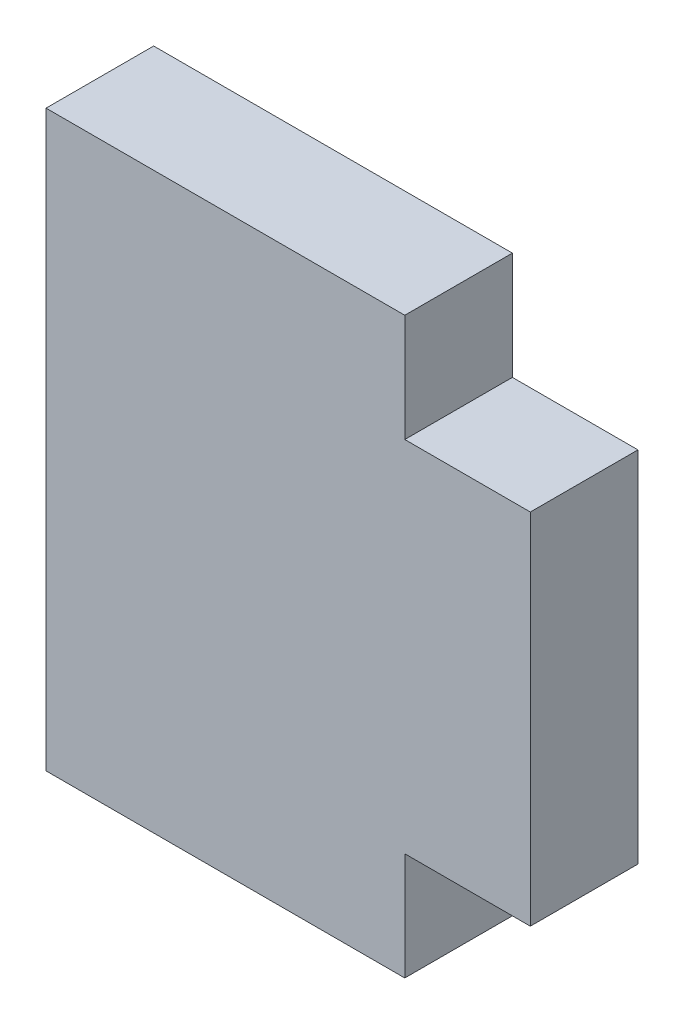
ISO-10303-21;
HEADER;
FILE_DESCRIPTION(('STEP AP214'),'2;1');
FILE_NAME('part.step','',(''),(''),'','','');
FILE_SCHEMA(('AUTOMOTIVE_DESIGN { 1 0 10303 214 1 1 1 1 }'));
ENDSEC;
DATA;
#1=APPLICATION_CONTEXT('core data for automotive mechanical design processes');
#2=APPLICATION_PROTOCOL_DEFINITION('international standard','automotive_design',2000,#1);
#3=PRODUCT_CONTEXT('',#1,'mechanical');
#4=PRODUCT('Part','Part','',(#3));
#5=PRODUCT_RELATED_PRODUCT_CATEGORY('part','',(#4));
#6=PRODUCT_DEFINITION_FORMATION('','',#4);
#7=PRODUCT_DEFINITION_CONTEXT('part definition',#1,'design');
#8=PRODUCT_DEFINITION('design','',#6,#7);
#9=PRODUCT_DEFINITION_SHAPE('','',#8);
#10=(LENGTH_UNIT() NAMED_UNIT(*) SI_UNIT(.MILLI.,.METRE.));
#11=(NAMED_UNIT(*) PLANE_ANGLE_UNIT() SI_UNIT($,.RADIAN.));
#12=(NAMED_UNIT(*) SI_UNIT($,.STERADIAN.) SOLID_ANGLE_UNIT());
#13=UNCERTAINTY_MEASURE_WITH_UNIT(LENGTH_MEASURE(1.E-05),#10,'distance_accuracy_value','');
#14=(GEOMETRIC_REPRESENTATION_CONTEXT(3) GLOBAL_UNCERTAINTY_ASSIGNED_CONTEXT((#13)) GLOBAL_UNIT_ASSIGNED_CONTEXT((#10,
#11,#12)) REPRESENTATION_CONTEXT('',''));
#15=CARTESIAN_POINT('',(0.,0.,0.));
#16=DIRECTION('',(0.,0.,1.));
#17=DIRECTION('',(1.,0.,0.));
#18=AXIS2_PLACEMENT_3D('',#15,#16,#17);
#19=CARTESIAN_POINT('',(-325.028662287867,211.342156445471,6.));
#20=DIRECTION('',(0.,1.,0.));
#21=DIRECTION('',(0.,0.,1.));
#22=AXIS2_PLACEMENT_3D('',#19,#20,#21);
#23=PLANE('',#22);
#24=DIRECTION('',(1.,0.,0.));
#25=VECTOR('',#24,1.);
#26=CARTESIAN_POINT('',(-325.028662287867,211.342156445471,0.));
#27=LINE('',#26,#25);
#28=CARTESIAN_POINT('',(-325.028662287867,211.342156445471,0.));
#29=VERTEX_POINT('',#28);
#30=CARTESIAN_POINT('',(-305.028662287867,211.342156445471,0.));
#31=VERTEX_POINT('',#30);
#32=EDGE_CURVE('E129',#29,#31,#27,.T.);
#33=ORIENTED_EDGE('',*,*,#32,.T.);
#34=DIRECTION('',(0.,0.,-1.));
#35=VECTOR('',#34,1.);
#36=CARTESIAN_POINT('',(-305.028662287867,211.342156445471,6.));
#37=LINE('',#36,#35);
#38=CARTESIAN_POINT('',(-305.028662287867,211.342156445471,6.));
#39=VERTEX_POINT('',#38);
#40=EDGE_CURVE('E11',#39,#31,#37,.T.);
#41=ORIENTED_EDGE('',*,*,#40,.F.);
#42=DIRECTION('',(1.,0.,0.));
#43=VECTOR('',#42,1.);
#44=CARTESIAN_POINT('',(-325.028662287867,211.342156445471,6.));
#45=LINE('',#44,#43);
#46=CARTESIAN_POINT('',(-325.028662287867,211.342156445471,6.));
#47=VERTEX_POINT('',#46);
#48=EDGE_CURVE('E144',#47,#39,#45,.T.);
#49=ORIENTED_EDGE('',*,*,#48,.F.);
#50=DIRECTION('',(0.,0.,-1.));
#51=VECTOR('',#50,1.);
#52=CARTESIAN_POINT('',(-325.028662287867,211.342156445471,6.));
#53=LINE('',#52,#51);
#54=EDGE_CURVE('E125',#47,#29,#53,.T.);
#55=ORIENTED_EDGE('',*,*,#54,.T.);
#56=EDGE_LOOP('',(#33,#41,#49,#55));
#57=FACE_BOUND('',#56,.T.);
#58=ADVANCED_FACE('F32',(#57),#23,.F.);
#59=CARTESIAN_POINT('',(-305.028662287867,211.342156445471,6.));
#60=DIRECTION('',(-1.,0.,0.));
#61=DIRECTION('',(0.,0.,1.));
#62=AXIS2_PLACEMENT_3D('',#59,#60,#61);
#63=PLANE('',#62);
#64=DIRECTION('',(0.,1.,0.));
#65=VECTOR('',#64,1.);
#66=CARTESIAN_POINT('',(-305.028662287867,211.342156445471,0.));
#67=LINE('',#66,#65);
#68=CARTESIAN_POINT('',(-305.028662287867,217.342156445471,0.));
#69=VERTEX_POINT('',#68);
#70=EDGE_CURVE('E132',#31,#69,#67,.T.);
#71=ORIENTED_EDGE('',*,*,#70,.T.);
#72=DIRECTION('',(0.,0.,-1.));
#73=VECTOR('',#72,1.);
#74=CARTESIAN_POINT('',(-305.028662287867,217.342156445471,6.));
#75=LINE('',#74,#73);
#76=CARTESIAN_POINT('',(-305.028662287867,217.342156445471,6.));
#77=VERTEX_POINT('',#76);
#78=EDGE_CURVE('E40',#77,#69,#75,.T.);
#79=ORIENTED_EDGE('',*,*,#78,.F.);
#80=DIRECTION('',(0.,1.,0.));
#81=VECTOR('',#80,1.);
#82=CARTESIAN_POINT('',(-305.028662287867,211.342156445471,6.));
#83=LINE('',#82,#81);
#84=EDGE_CURVE('E89',#39,#77,#83,.T.);
#85=ORIENTED_EDGE('',*,*,#84,.F.);
#86=ORIENTED_EDGE('',*,*,#40,.T.);
#87=EDGE_LOOP('',(#71,#79,#85,#86));
#88=FACE_BOUND('',#87,.T.);
#89=ADVANCED_FACE('F177',(#88),#63,.F.);
#90=CARTESIAN_POINT('',(-305.028662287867,217.342156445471,6.));
#91=DIRECTION('',(0.,1.,0.));
#92=DIRECTION('',(0.,0.,1.));
#93=AXIS2_PLACEMENT_3D('',#90,#91,#92);
#94=PLANE('',#93);
#95=DIRECTION('',(1.,0.,0.));
#96=VECTOR('',#95,1.);
#97=CARTESIAN_POINT('',(-305.028662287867,217.342156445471,0.));
#98=LINE('',#97,#96);
#99=CARTESIAN_POINT('',(-298.028662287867,217.342156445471,0.));
#100=VERTEX_POINT('',#99);
#101=EDGE_CURVE('E134',#69,#100,#98,.T.);
#102=ORIENTED_EDGE('',*,*,#101,.T.);
#103=DIRECTION('',(0.,0.,-1.));
#104=VECTOR('',#103,1.);
#105=CARTESIAN_POINT('',(-298.028662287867,217.342156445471,6.));
#106=LINE('',#105,#104);
#107=CARTESIAN_POINT('',(-298.028662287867,217.342156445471,6.));
#108=VERTEX_POINT('',#107);
#109=EDGE_CURVE('E151',#108,#100,#106,.T.);
#110=ORIENTED_EDGE('',*,*,#109,.F.);
#111=DIRECTION('',(1.,0.,0.));
#112=VECTOR('',#111,1.);
#113=CARTESIAN_POINT('',(-305.028662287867,217.342156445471,6.));
#114=LINE('',#113,#112);
#115=EDGE_CURVE('E159',#77,#108,#114,.T.);
#116=ORIENTED_EDGE('',*,*,#115,.F.);
#117=ORIENTED_EDGE('',*,*,#78,.T.);
#118=EDGE_LOOP('',(#102,#110,#116,#117));
#119=FACE_BOUND('',#118,.T.);
#120=ADVANCED_FACE('F157',(#119),#94,.F.);
#121=CARTESIAN_POINT('',(-298.028662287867,217.342156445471,6.));
#122=DIRECTION('',(-1.,0.,0.));
#123=DIRECTION('',(0.,0.,1.));
#124=AXIS2_PLACEMENT_3D('',#121,#122,#123);
#125=PLANE('',#124);
#126=DIRECTION('',(0.,1.,0.));
#127=VECTOR('',#126,1.);
#128=CARTESIAN_POINT('',(-298.028662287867,217.342156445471,0.));
#129=LINE('',#128,#127);
#130=CARTESIAN_POINT('',(-298.028662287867,237.342156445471,0.));
#131=VERTEX_POINT('',#130);
#132=EDGE_CURVE('E136',#100,#131,#129,.T.);
#133=ORIENTED_EDGE('',*,*,#132,.T.);
#134=DIRECTION('',(0.,0.,-1.));
#135=VECTOR('',#134,1.);
#136=CARTESIAN_POINT('',(-298.028662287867,237.342156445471,6.));
#137=LINE('',#136,#135);
#138=CARTESIAN_POINT('',(-298.028662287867,237.342156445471,6.));
#139=VERTEX_POINT('',#138);
#140=EDGE_CURVE('E148',#139,#131,#137,.T.);
#141=ORIENTED_EDGE('',*,*,#140,.F.);
#142=DIRECTION('',(0.,1.,0.));
#143=VECTOR('',#142,1.);
#144=CARTESIAN_POINT('',(-298.028662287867,217.342156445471,6.));
#145=LINE('',#144,#143);
#146=EDGE_CURVE('E169',#108,#139,#145,.T.);
#147=ORIENTED_EDGE('',*,*,#146,.F.);
#148=ORIENTED_EDGE('',*,*,#109,.T.);
#149=EDGE_LOOP('',(#133,#141,#147,#148));
#150=FACE_BOUND('',#149,.T.);
#151=ADVANCED_FACE('F165',(#150),#125,.F.);
#152=CARTESIAN_POINT('',(-298.028662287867,237.342156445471,6.));
#153=DIRECTION('',(0.,-1.,0.));
#154=DIRECTION('',(0.,0.,-1.));
#155=AXIS2_PLACEMENT_3D('',#152,#153,#154);
#156=PLANE('',#155);
#157=DIRECTION('',(-1.,0.,0.));
#158=VECTOR('',#157,1.);
#159=CARTESIAN_POINT('',(-298.028662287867,237.342156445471,0.));
#160=LINE('',#159,#158);
#161=CARTESIAN_POINT('',(-305.028662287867,237.342156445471,0.));
#162=VERTEX_POINT('',#161);
#163=EDGE_CURVE('E138',#131,#162,#160,.T.);
#164=ORIENTED_EDGE('',*,*,#163,.T.);
#165=DIRECTION('',(0.,0.,-1.));
#166=VECTOR('',#165,1.);
#167=CARTESIAN_POINT('',(-305.028662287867,237.342156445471,6.));
#168=LINE('',#167,#166);
#169=CARTESIAN_POINT('',(-305.028662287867,237.342156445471,6.));
#170=VERTEX_POINT('',#169);
#171=EDGE_CURVE('E120',#170,#162,#168,.T.);
#172=ORIENTED_EDGE('',*,*,#171,.F.);
#173=DIRECTION('',(-1.,0.,0.));
#174=VECTOR('',#173,1.);
#175=CARTESIAN_POINT('',(-298.028662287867,237.342156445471,6.));
#176=LINE('',#175,#174);
#177=EDGE_CURVE('E109',#139,#170,#176,.T.);
#178=ORIENTED_EDGE('',*,*,#177,.F.);
#179=ORIENTED_EDGE('',*,*,#140,.T.);
#180=EDGE_LOOP('',(#164,#172,#178,#179));
#181=FACE_BOUND('',#180,.T.);
#182=ADVANCED_FACE('F168',(#181),#156,.F.);
#183=CARTESIAN_POINT('',(-305.028662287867,237.342156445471,6.));
#184=DIRECTION('',(-1.,0.,0.));
#185=DIRECTION('',(0.,0.,1.));
#186=AXIS2_PLACEMENT_3D('',#183,#184,#185);
#187=PLANE('',#186);
#188=DIRECTION('',(0.,1.,0.));
#189=VECTOR('',#188,1.);
#190=CARTESIAN_POINT('',(-305.028662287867,237.342156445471,0.));
#191=LINE('',#190,#189);
#192=CARTESIAN_POINT('',(-305.028662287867,243.342156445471,0.));
#193=VERTEX_POINT('',#192);
#194=EDGE_CURVE('E118',#162,#193,#191,.T.);
#195=ORIENTED_EDGE('',*,*,#194,.T.);
#196=DIRECTION('',(0.,0.,-1.));
#197=VECTOR('',#196,1.);
#198=CARTESIAN_POINT('',(-305.028662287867,243.342156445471,6.));
#199=LINE('',#198,#197);
#200=CARTESIAN_POINT('',(-305.028662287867,243.342156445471,6.));
#201=VERTEX_POINT('',#200);
#202=EDGE_CURVE('E115',#201,#193,#199,.T.);
#203=ORIENTED_EDGE('',*,*,#202,.F.);
#204=DIRECTION('',(0.,1.,0.));
#205=VECTOR('',#204,1.);
#206=CARTESIAN_POINT('',(-305.028662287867,237.342156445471,6.));
#207=LINE('',#206,#205);
#208=EDGE_CURVE('E102',#170,#201,#207,.T.);
#209=ORIENTED_EDGE('',*,*,#208,.F.);
#210=ORIENTED_EDGE('',*,*,#171,.T.);
#211=EDGE_LOOP('',(#195,#203,#209,#210));
#212=FACE_BOUND('',#211,.T.);
#213=ADVANCED_FACE('F116',(#212),#187,.F.);
#214=CARTESIAN_POINT('',(-305.028662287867,243.342156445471,6.));
#215=DIRECTION('',(0.,-1.,0.));
#216=DIRECTION('',(0.,0.,-1.));
#217=AXIS2_PLACEMENT_3D('',#214,#215,#216);
#218=PLANE('',#217);
#219=DIRECTION('',(-1.,0.,0.));
#220=VECTOR('',#219,1.);
#221=CARTESIAN_POINT('',(-305.028662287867,243.342156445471,0.));
#222=LINE('',#221,#220);
#223=CARTESIAN_POINT('',(-325.028662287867,243.342156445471,0.));
#224=VERTEX_POINT('',#223);
#225=EDGE_CURVE('E141',#193,#224,#222,.T.);
#226=ORIENTED_EDGE('',*,*,#225,.T.);
#227=DIRECTION('',(0.,0.,-1.));
#228=VECTOR('',#227,1.);
#229=CARTESIAN_POINT('',(-325.028662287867,243.342156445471,6.));
#230=LINE('',#229,#228);
#231=CARTESIAN_POINT('',(-325.028662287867,243.342156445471,6.));
#232=VERTEX_POINT('',#231);
#233=EDGE_CURVE('E121',#232,#224,#230,.T.);
#234=ORIENTED_EDGE('',*,*,#233,.F.);
#235=DIRECTION('',(-1.,0.,0.));
#236=VECTOR('',#235,1.);
#237=CARTESIAN_POINT('',(-305.028662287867,243.342156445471,6.));
#238=LINE('',#237,#236);
#239=EDGE_CURVE('E106',#201,#232,#238,.T.);
#240=ORIENTED_EDGE('',*,*,#239,.F.);
#241=ORIENTED_EDGE('',*,*,#202,.T.);
#242=EDGE_LOOP('',(#226,#234,#240,#241));
#243=FACE_BOUND('',#242,.T.);
#244=ADVANCED_FACE('F123',(#243),#218,.F.);
#245=CARTESIAN_POINT('',(-325.028662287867,237.342156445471,6.));
#246=DIRECTION('',(1.,0.,0.));
#247=DIRECTION('',(0.,0.,-1.));
#248=AXIS2_PLACEMENT_3D('',#245,#246,#247);
#249=PLANE('',#248);
#250=DIRECTION('',(0.,-1.,0.));
#251=VECTOR('',#250,1.);
#252=CARTESIAN_POINT('',(-325.028662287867,237.342156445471,0.));
#253=LINE('',#252,#251);
#254=EDGE_CURVE('E77',#224,#29,#253,.T.);
#255=ORIENTED_EDGE('',*,*,#254,.T.);
#256=ORIENTED_EDGE('',*,*,#54,.F.);
#257=DIRECTION('',(0.,-1.,0.));
#258=VECTOR('',#257,1.);
#259=CARTESIAN_POINT('',(-325.028662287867,243.342156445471,6.));
#260=LINE('',#259,#258);
#261=EDGE_CURVE('E48',#232,#47,#260,.T.);
#262=ORIENTED_EDGE('',*,*,#261,.F.);
#263=ORIENTED_EDGE('',*,*,#233,.T.);
#264=EDGE_LOOP('',(#255,#256,#262,#263));
#265=FACE_BOUND('',#264,.T.);
#266=ADVANCED_FACE('F193',(#265),#249,.F.);
#267=CARTESIAN_POINT('',(-305.028662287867,211.342156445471,6.));
#268=DIRECTION('',(0.,0.,1.));
#269=DIRECTION('',(1.,0.,0.));
#270=AXIS2_PLACEMENT_3D('',#267,#268,#269);
#271=PLANE('',#270);
#272=ORIENTED_EDGE('',*,*,#48,.T.);
#273=ORIENTED_EDGE('',*,*,#84,.T.);
#274=ORIENTED_EDGE('',*,*,#115,.T.);
#275=ORIENTED_EDGE('',*,*,#146,.T.);
#276=ORIENTED_EDGE('',*,*,#177,.T.);
#277=ORIENTED_EDGE('',*,*,#208,.T.);
#278=ORIENTED_EDGE('',*,*,#239,.T.);
#279=ORIENTED_EDGE('',*,*,#261,.T.);
#280=EDGE_LOOP('',(#272,#273,#274,#275,#276,#277,#278,#279));
#281=FACE_BOUND('',#280,.T.);
#282=ADVANCED_FACE('F104',(#281),#271,.T.);
#283=CARTESIAN_POINT('',(-305.028662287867,211.342156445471,0.));
#284=DIRECTION('',(0.,0.,1.));
#285=DIRECTION('',(1.,0.,0.));
#286=AXIS2_PLACEMENT_3D('',#283,#284,#285);
#287=PLANE('',#286);
#288=ORIENTED_EDGE('',*,*,#32,.F.);
#289=ORIENTED_EDGE('',*,*,#254,.F.);
#290=ORIENTED_EDGE('',*,*,#225,.F.);
#291=ORIENTED_EDGE('',*,*,#194,.F.);
#292=ORIENTED_EDGE('',*,*,#163,.F.);
#293=ORIENTED_EDGE('',*,*,#132,.F.);
#294=ORIENTED_EDGE('',*,*,#101,.F.);
#295=ORIENTED_EDGE('',*,*,#70,.F.);
#296=EDGE_LOOP('',(#288,#289,#290,#291,#292,#293,#294,#295));
#297=FACE_BOUND('',#296,.T.);
#298=ADVANCED_FACE('F161',(#297),#287,.F.);
#299=CLOSED_SHELL('',(#58,#89,#120,#151,#182,#213,#244,#266,#282,#298));
#300=MANIFOLD_SOLID_BREP('B2',#299);
#301=ADVANCED_BREP_SHAPE_REPRESENTATION('',(#18,#300),#14);
#302=SHAPE_DEFINITION_REPRESENTATION(#9,#301);
ENDSEC;
END-ISO-10303-21;
